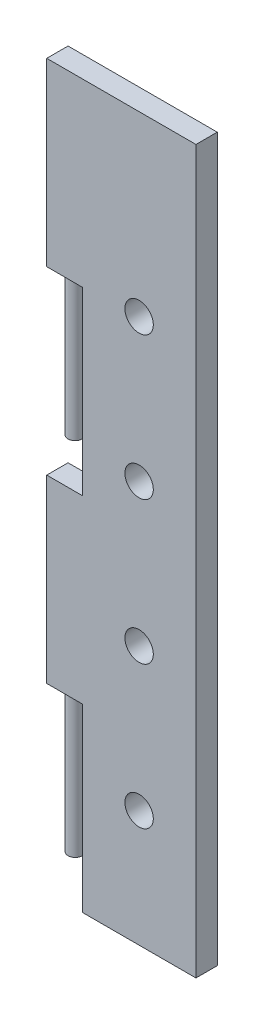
from build123d import *

# Parameters (mm, degrees)
SKETCH1_W           = 16
SKETCH1_H           = 101.6
SKETCH1_R           = 2
BOSS_EXTRUDE1_DEPTH = 3
SKETCH3_W           = 3
SKETCH3_H           = 25.4
BOSS_EXTRUDE3_DEPTH = 5
SKETCH7_R           = 1
BOSS_EXTRUDE4_DEPTH = 20
SKETCH6_R           = 1
BOSS_EXTRUDE5_DEPTH = 20


with BuildPart() as part:
    # Sketch1 → Boss-Extrude1 (new body)
    with BuildSketch(Plane.XY):
        Rectangle(SKETCH1_W, SKETCH1_H)
        with Locations((0, 25.8)):
            Circle(SKETCH1_R, mode=Mode.SUBTRACT)
        with Locations((0, 5.734)):
            Circle(SKETCH1_R, mode=Mode.SUBTRACT)
        with Locations((0, -14.332)):
            Circle(SKETCH1_R, mode=Mode.SUBTRACT)
        with Locations((0, -34.398)):
            Circle(SKETCH1_R, mode=Mode.SUBTRACT)
    extrude(amount=BOSS_EXTRUDE1_DEPTH)

    # Sketch3 → Boss-Extrude3 (add)
    with BuildSketch(Plane.ZY.offset(8)):
        with Locations((1.5, 38.1)):
            Rectangle(SKETCH3_W, SKETCH3_H)
        with Locations((1.5, -12.7)):
            Rectangle(SKETCH3_W, SKETCH3_H)
    extrude(amount=BOSS_EXTRUDE3_DEPTH)

    # Sketch7 → Boss-Extrude4 (add)
    with BuildSketch(Plane.XZ.offset(25.4)):
        with Locations(Location((-10.5, 1.5, 0), (0, 0, 90))):
            Circle(SKETCH7_R)
    extrude(amount=BOSS_EXTRUDE4_DEPTH)

    # Sketch6 → Boss-Extrude5 (add)
    with BuildSketch(Plane.XZ.offset(-25.4)):
        with Locations(Location((-10.5, 1.5, 0), (0, 0, 90))):
            Circle(SKETCH6_R)
    extrude(amount=BOSS_EXTRUDE5_DEPTH)


solid = part.part
